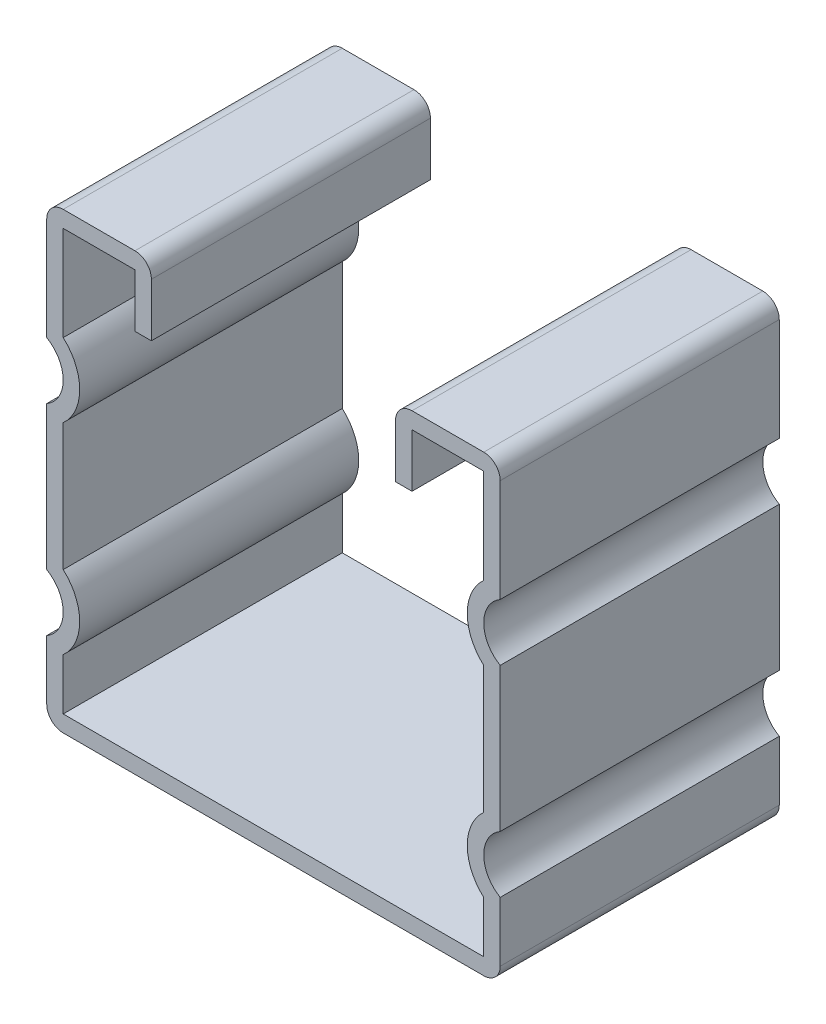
from build123d import *

# Parameters (mm, degrees)
BASE_EXTRUDE_DEPTH = 12.7


with BuildPart() as part:
    # Sketch1 → Base-Extrude (new, symmetric)
    with BuildSketch(Plane.XY):
        with BuildLine():
            Line((-20.6375, 21.1074), (-20.6375, 11.73965134))
            ThreePointArc((-20.6375, 11.73965134), (-19.1389, 9.144), (-20.6375, 6.54834866))
            Line((-20.6375, 6.54834866), (-20.6375, -6.54834866))
            ThreePointArc((-20.6375, -6.54834866), (-19.1389, -9.144), (-20.6375, -11.73965134))
            Line((-20.6375, -11.73965134), (-20.6375, -17.1704))
            ThreePointArc((-20.6375, -17.1704), (-20.198570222, -18.230070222), (-19.1389, -18.669))
            Line((-19.1389, -18.669), (19.1389, -18.669))
            ThreePointArc((19.1389, -18.669), (20.198570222, -18.230070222), (20.6375, -17.1704))
            Line((20.6375, -17.1704), (20.6375, -11.73965134))
            ThreePointArc((20.6375, -11.73965134), (19.1389, -9.144), (20.6375, -6.54834866))
            Line((20.6375, -6.54834866), (20.6375, 6.54834866))
            ThreePointArc((20.6375, 6.54834866), (19.1389, 9.144), (20.6375, 11.73965134))
            Line((20.6375, 11.73965134), (20.6375, 21.1074))
            ThreePointArc((20.6375, 21.1074), (20.198570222, 22.167070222), (19.1389, 22.606))
            Line((19.1389, 22.606), (12.6111, 22.606))
            ThreePointArc((12.6111, 22.606), (11.551429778, 22.167070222), (11.1125, 21.1074))
            Line((11.1125, 21.1074), (11.1125, 16.256))
            Line((11.1125, 16.256), (12.6111, 16.256))
            Line((12.6111, 16.256), (12.6111, 21.1074))
            Line((12.6111, 21.1074), (19.1389, 21.1074))
            Line((19.1389, 21.1074), (19.1389, 12.494971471))
            ThreePointArc((19.1389, 12.494971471), (17.6403, 9.144), (19.1389, 5.793028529))
            Line((19.1389, 5.793028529), (19.1389, -5.793028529))
            ThreePointArc((19.1389, -5.793028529), (17.6403, -9.144), (19.1389, -12.494971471))
            Line((19.1389, -12.494971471), (19.1389, -17.1704))
            Line((19.1389, -17.1704), (-19.1389, -17.1704))
            Line((-19.1389, -17.1704), (-19.1389, -12.494971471))
            ThreePointArc((-19.1389, -12.494971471), (-17.6403, -9.144), (-19.1389, -5.793028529))
            Line((-19.1389, -5.793028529), (-19.1389, 5.793028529))
            ThreePointArc((-19.1389, 5.793028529), (-17.6403, 9.144), (-19.1389, 12.494971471))
            Line((-19.1389, 12.494971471), (-19.1389, 21.1074))
            Line((-19.1389, 21.1074), (-12.6111, 21.1074))
            Line((-12.6111, 21.1074), (-12.6111, 16.256))
            Line((-12.6111, 16.256), (-11.1125, 16.256))
            Line((-11.1125, 16.256), (-11.1125, 21.1074))
            ThreePointArc((-11.1125, 21.1074), (-11.551429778, 22.167070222), (-12.6111, 22.606))
            Line((-12.6111, 22.606), (-19.1389, 22.606))
            ThreePointArc((-19.1389, 22.606), (-20.198570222, 22.167070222), (-20.6375, 21.1074))
        make_face()
    extrude(amount=BASE_EXTRUDE_DEPTH, both=True)


solid = part.part
